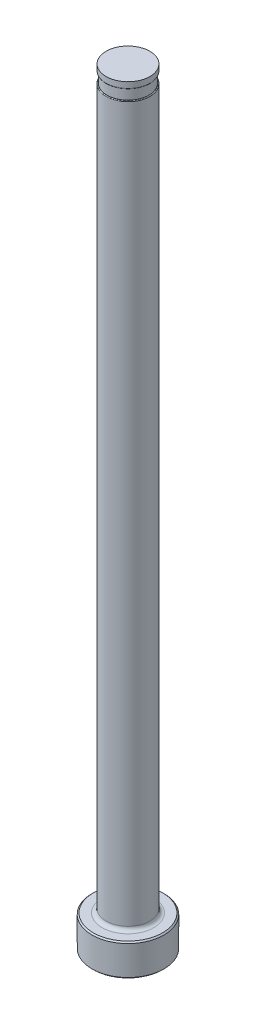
ISO-10303-21;
HEADER;
FILE_DESCRIPTION(('STEP AP214'),'2;1');
FILE_NAME('part.step','',(''),(''),'','','');
FILE_SCHEMA(('AUTOMOTIVE_DESIGN { 1 0 10303 214 1 1 1 1 }'));
ENDSEC;
DATA;
#1=APPLICATION_CONTEXT('core data for automotive mechanical design processes');
#2=APPLICATION_PROTOCOL_DEFINITION('international standard','automotive_design',2000,#1);
#3=PRODUCT_CONTEXT('',#1,'mechanical');
#4=PRODUCT('Part','Part','',(#3));
#5=PRODUCT_RELATED_PRODUCT_CATEGORY('part','',(#4));
#6=PRODUCT_DEFINITION_FORMATION('','',#4);
#7=PRODUCT_DEFINITION_CONTEXT('part definition',#1,'design');
#8=PRODUCT_DEFINITION('design','',#6,#7);
#9=PRODUCT_DEFINITION_SHAPE('','',#8);
#10=(LENGTH_UNIT() NAMED_UNIT(*) SI_UNIT(.MILLI.,.METRE.));
#11=(NAMED_UNIT(*) PLANE_ANGLE_UNIT() SI_UNIT($,.RADIAN.));
#12=(NAMED_UNIT(*) SI_UNIT($,.STERADIAN.) SOLID_ANGLE_UNIT());
#13=UNCERTAINTY_MEASURE_WITH_UNIT(LENGTH_MEASURE(1.E-05),#10,'distance_accuracy_value','');
#14=(GEOMETRIC_REPRESENTATION_CONTEXT(3) GLOBAL_UNCERTAINTY_ASSIGNED_CONTEXT((#13)) GLOBAL_UNIT_ASSIGNED_CONTEXT((#10,
#11,#12)) REPRESENTATION_CONTEXT('',''));
#15=CARTESIAN_POINT('',(0.,0.,0.));
#16=DIRECTION('',(0.,0.,1.));
#17=DIRECTION('',(1.,0.,0.));
#18=AXIS2_PLACEMENT_3D('',#15,#16,#17);
#19=CARTESIAN_POINT('',(-4.36498999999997,151.13,0.));
#20=DIRECTION('',(0.,1.,0.));
#21=DIRECTION('',(0.,0.,1.));
#22=AXIS2_PLACEMENT_3D('',#19,#20,#21);
#23=PLANE('',#22);
#24=CARTESIAN_POINT('',(0.,151.13,0.));
#25=DIRECTION('',(0.,1.,0.));
#26=DIRECTION('',(0.,0.,1.));
#27=AXIS2_PLACEMENT_3D('',#24,#25,#26);
#28=CIRCLE('',#27,4.22528999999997);
#29=CARTESIAN_POINT('',(0.,151.13,4.22528999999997));
#30=VERTEX_POINT('',#29);
#31=EDGE_CURVE('E11',#30,#30,#28,.F.);
#32=ORIENTED_EDGE('',*,*,#31,.T.);
#33=EDGE_LOOP('',(#32));
#34=FACE_BOUND('',#33,.T.);
#35=CARTESIAN_POINT('',(0.,151.13,0.));
#36=DIRECTION('',(0.,1.,0.));
#37=DIRECTION('',(0.,0.,1.));
#38=AXIS2_PLACEMENT_3D('',#35,#36,#37);
#39=CIRCLE('',#38,4.16178999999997);
#40=CARTESIAN_POINT('',(0.,151.13,4.16178999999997));
#41=VERTEX_POINT('',#40);
#42=EDGE_CURVE('E78',#41,#41,#39,.T.);
#43=ORIENTED_EDGE('',*,*,#42,.T.);
#44=EDGE_LOOP('',(#43));
#45=FACE_BOUND('',#44,.T.);
#46=ADVANCED_FACE('F36',(#34,#45),#23,.F.);
#47=CARTESIAN_POINT('',(0.,259.958771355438,0.));
#48=DIRECTION('',(0.,1.,0.));
#49=DIRECTION('',(0.,0.,1.));
#50=AXIS2_PLACEMENT_3D('',#47,#48,#49);
#51=CYLINDRICAL_SURFACE('',#50,4.36498999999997);
#52=DIRECTION('',(0.,1.,0.));
#53=VECTOR('',#52,1.);
#54=CARTESIAN_POINT('',(-4.16178999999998,259.958771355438,-1.31629848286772));
#55=LINE('',#54,#53);
#56=CARTESIAN_POINT('',(-4.16178999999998,148.971,-1.31629848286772));
#57=VERTEX_POINT('',#56);
#58=CARTESIAN_POINT('',(-4.16178999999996,86.614,-1.31629848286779));
#59=VERTEX_POINT('',#58);
#60=EDGE_CURVE('E73',#57,#59,#55,.F.);
#61=ORIENTED_EDGE('',*,*,#60,.F.);
#62=CARTESIAN_POINT('',(0.,148.971,0.));
#63=DIRECTION('',(0.,-1.,0.));
#64=DIRECTION('',(0.,0.,-1.));
#65=AXIS2_PLACEMENT_3D('',#62,#63,#64);
#66=CIRCLE('',#65,4.36498999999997);
#67=CARTESIAN_POINT('',(-4.16178999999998,148.971,1.31629848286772));
#68=VERTEX_POINT('',#67);
#69=EDGE_CURVE('E51',#57,#68,#66,.T.);
#70=ORIENTED_EDGE('',*,*,#69,.T.);
#71=DIRECTION('',(0.,1.,0.));
#72=VECTOR('',#71,1.);
#73=CARTESIAN_POINT('',(-4.16178999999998,259.958771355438,1.31629848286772));
#74=LINE('',#73,#72);
#75=CARTESIAN_POINT('',(-4.16178999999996,86.614,1.31629848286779));
#76=VERTEX_POINT('',#75);
#77=EDGE_CURVE('E84',#76,#68,#74,.T.);
#78=ORIENTED_EDGE('',*,*,#77,.F.);
#79=CARTESIAN_POINT('',(-4.16178999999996,86.614,-1.31629848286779));
#80=CARTESIAN_POINT('',(-4.16178749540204,86.5847945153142,-1.31629969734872));
#81=CARTESIAN_POINT('',(-4.1621934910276,86.5556054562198,-1.31502339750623));
#82=CARTESIAN_POINT('',(-4.16379602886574,86.4974799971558,-1.30994313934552));
#83=CARTESIAN_POINT('',(-4.16499229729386,86.4685435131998,-1.30614005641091));
#84=CARTESIAN_POINT('',(-4.16970978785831,86.3827304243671,-1.29103636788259));
#85=CARTESIAN_POINT('',(-4.1743602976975,86.3265217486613,-1.27604058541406));
#86=CARTESIAN_POINT('',(-4.18613251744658,86.2177895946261,-1.23686822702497));
#87=CARTESIAN_POINT('',(-4.19325232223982,86.1652633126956,-1.2126987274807));
#88=CARTESIAN_POINT('',(-4.2091888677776,86.0650804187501,-1.1561686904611));
#89=CARTESIAN_POINT('',(-4.21800681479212,86.0174273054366,-1.12380232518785));
#90=CARTESIAN_POINT('',(-4.23656898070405,85.9274175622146,-1.05167440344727));
#91=CARTESIAN_POINT('',(-4.24632261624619,85.8851275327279,-1.01183271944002));
#92=CARTESIAN_POINT('',(-4.26580066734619,85.8069847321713,-0.926286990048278));
#93=CARTESIAN_POINT('',(-4.27552507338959,85.7711338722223,-0.88058121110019));
#94=CARTESIAN_POINT('',(-4.29543366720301,85.701720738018,-0.778110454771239));
#95=CARTESIAN_POINT('',(-4.3055056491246,85.669104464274,-0.720683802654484));
#96=CARTESIAN_POINT('',(-4.32376922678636,85.6123921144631,-0.601498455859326));
#97=CARTESIAN_POINT('',(-4.33195978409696,85.5883007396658,-0.539737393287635));
#98=CARTESIAN_POINT('',(-4.34685789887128,85.5455798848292,-0.404062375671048));
#99=CARTESIAN_POINT('',(-4.35317398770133,85.5282625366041,-0.329691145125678));
#100=CARTESIAN_POINT('',(-4.36197215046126,85.5043864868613,-0.179011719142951));
#101=CARTESIAN_POINT('',(-4.3644520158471,85.4978339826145,-0.102702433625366));
#102=CARTESIAN_POINT('',(-4.36541803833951,85.4952580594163,0.058182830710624));
#103=CARTESIAN_POINT('',(-4.36345629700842,85.5004156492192,0.142783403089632));
#104=CARTESIAN_POINT('',(-4.35477620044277,85.5238747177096,0.309955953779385));
#105=CARTESIAN_POINT('',(-4.34805523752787,85.5421834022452,0.392526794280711));
#106=CARTESIAN_POINT('',(-4.33049146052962,85.5924757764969,0.55371755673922));
#107=CARTESIAN_POINT('',(-4.31961605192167,85.6245678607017,0.632300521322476));
#108=CARTESIAN_POINT('',(-4.29509465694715,85.7027472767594,0.78166915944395));
#109=CARTESIAN_POINT('',(-4.28145345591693,85.7488105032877,0.852467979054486));
#110=CARTESIAN_POINT('',(-4.25707286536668,85.8409515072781,0.96588299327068));
#111=CARTESIAN_POINT('',(-4.24649547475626,85.8839441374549,1.01105227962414));
#112=CARTESIAN_POINT('',(-4.22598230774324,85.9770038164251,1.09362608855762));
#113=CARTESIAN_POINT('',(-4.21604624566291,86.0270676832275,1.13103408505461));
#114=CARTESIAN_POINT('',(-4.19787550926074,86.1336091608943,1.19672699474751));
#115=CARTESIAN_POINT('',(-4.18965172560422,86.1901244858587,1.22495411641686));
#116=CARTESIAN_POINT('',(-4.17605152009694,86.3076762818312,1.27055384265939));
#117=CARTESIAN_POINT('',(-4.17067066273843,86.3687055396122,1.28794336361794));
#118=CARTESIAN_POINT('',(-4.1653318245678,86.4610266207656,1.30505888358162));
#119=CARTESIAN_POINT('',(-4.16400812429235,86.4914684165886,1.30926961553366));
#120=CARTESIAN_POINT('',(-4.16223627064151,86.5526003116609,1.31488836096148));
#121=CARTESIAN_POINT('',(-4.16178714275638,86.5832900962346,1.31629949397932));
#122=CARTESIAN_POINT('',(-4.16178999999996,86.614,1.31629848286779));
#123=B_SPLINE_CURVE_WITH_KNOTS('',3,(#79,#80,#81,#82,#83,#84,#85,#86,#87,#88,#89,#90,#91,#92,
#93,#94,#95,#96,#97,#98,#99,#100,#101,#102,#103,#104,#105,#106,#107,#108,#109,#110,#111,#112,
#113,#114,#115,#116,#117,#118,#119,#120,#121,#122),.UNSPECIFIED.,.F.,.F.,(4,2,2,2,2,2,2,2,2,2,2,
2,2,2,2,2,2,2,2,2,2,4),(0.,0.0875537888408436,0.175077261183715,0.349153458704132,
0.523095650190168,0.697161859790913,0.873213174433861,1.04931665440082,1.24895267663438,
1.44869862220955,1.6776260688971,1.90668526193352,2.15985748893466,2.41316854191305,
2.66850922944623,2.92341184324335,3.11238644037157,3.30127627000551,3.49133308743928,
3.68109249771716,3.77325015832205,3.86530507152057),.UNSPECIFIED.);
#124=EDGE_CURVE('E81',#59,#76,#123,.T.);
#125=ORIENTED_EDGE('',*,*,#124,.F.);
#126=EDGE_LOOP('',(#61,#70,#78,#125));
#127=FACE_BOUND('',#126,.T.);
#128=CARTESIAN_POINT('',(0.,7.11200000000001,0.));
#129=DIRECTION('',(0.,1.,0.));
#130=DIRECTION('',(0.,0.,1.));
#131=AXIS2_PLACEMENT_3D('',#128,#129,#130);
#132=CIRCLE('',#131,4.36498999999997);
#133=CARTESIAN_POINT('',(0.,7.11200000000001,4.36498999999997));
#134=VERTEX_POINT('',#133);
#135=EDGE_CURVE('E116',#134,#134,#132,.T.);
#136=ORIENTED_EDGE('',*,*,#135,.T.);
#137=EDGE_LOOP('',(#136));
#138=FACE_BOUND('',#137,.T.);
#139=ADVANCED_FACE('F82',(#127,#138),#51,.T.);
#140=CARTESIAN_POINT('',(0.,0.,0.));
#141=DIRECTION('',(0.,-1.,0.));
#142=DIRECTION('',(0.,0.,-1.));
#143=AXIS2_PLACEMENT_3D('',#140,#141,#142);
#144=PLANE('',#143);
#145=CARTESIAN_POINT('',(0.,0.,0.));
#146=DIRECTION('',(0.,-1.,0.));
#147=DIRECTION('',(0.,0.,-1.));
#148=AXIS2_PLACEMENT_3D('',#145,#146,#147);
#149=CIRCLE('',#148,6.88339999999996);
#150=CARTESIAN_POINT('',(0.,0.,-6.88339999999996));
#151=VERTEX_POINT('',#150);
#152=EDGE_CURVE('E113',#151,#151,#149,.T.);
#153=ORIENTED_EDGE('',*,*,#152,.T.);
#154=EDGE_LOOP('',(#153));
#155=FACE_BOUND('',#154,.T.);
#156=ADVANCED_FACE('F192',(#155),#144,.T.);
#157=CARTESIAN_POINT('',(0.,259.958771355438,0.));
#158=DIRECTION('',(0.,1.,0.));
#159=DIRECTION('',(0.,0.,1.));
#160=AXIS2_PLACEMENT_3D('',#157,#158,#159);
#161=CYLINDRICAL_SURFACE('',#160,7.13739999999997);
#162=CARTESIAN_POINT('',(0.,6.09599999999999,0.));
#163=DIRECTION('',(0.,1.,0.));
#164=DIRECTION('',(0.,0.,1.));
#165=AXIS2_PLACEMENT_3D('',#162,#163,#164);
#166=CIRCLE('',#165,7.13739999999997);
#167=CARTESIAN_POINT('',(0.,6.09599999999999,7.13739999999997));
#168=VERTEX_POINT('',#167);
#169=EDGE_CURVE('E110',#168,#168,#166,.F.);
#170=ORIENTED_EDGE('',*,*,#169,.T.);
#171=EDGE_LOOP('',(#170));
#172=FACE_BOUND('',#171,.T.);
#173=CARTESIAN_POINT('',(0.,0.254000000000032,0.));
#174=DIRECTION('',(0.,-1.,0.));
#175=DIRECTION('',(0.,0.,-1.));
#176=AXIS2_PLACEMENT_3D('',#173,#174,#175);
#177=CIRCLE('',#176,7.13739999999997);
#178=CARTESIAN_POINT('',(0.,0.254000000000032,-7.13739999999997));
#179=VERTEX_POINT('',#178);
#180=EDGE_CURVE('E107',#179,#179,#177,.F.);
#181=ORIENTED_EDGE('',*,*,#180,.T.);
#182=EDGE_LOOP('',(#181));
#183=FACE_BOUND('',#182,.T.);
#184=ADVANCED_FACE('F195',(#172,#183),#161,.T.);
#185=CARTESIAN_POINT('',(-7.13739999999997,6.35,0.));
#186=DIRECTION('',(0.,1.,0.));
#187=DIRECTION('',(0.,0.,1.));
#188=AXIS2_PLACEMENT_3D('',#185,#186,#187);
#189=PLANE('',#188);
#190=CARTESIAN_POINT('',(0.,6.35,0.));
#191=DIRECTION('',(0.,1.,0.));
#192=DIRECTION('',(0.,0.,1.));
#193=AXIS2_PLACEMENT_3D('',#190,#191,#192);
#194=CIRCLE('',#193,5.12698999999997);
#195=CARTESIAN_POINT('',(0.,6.35,5.12698999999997));
#196=VERTEX_POINT('',#195);
#197=EDGE_CURVE('E87',#196,#196,#194,.F.);
#198=ORIENTED_EDGE('',*,*,#197,.T.);
#199=EDGE_LOOP('',(#198));
#200=FACE_BOUND('',#199,.T.);
#201=CARTESIAN_POINT('',(0.,6.35,0.));
#202=DIRECTION('',(0.,1.,0.));
#203=DIRECTION('',(0.,0.,1.));
#204=AXIS2_PLACEMENT_3D('',#201,#202,#203);
#205=CIRCLE('',#204,6.88340000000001);
#206=CARTESIAN_POINT('',(0.,6.35,6.88340000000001));
#207=VERTEX_POINT('',#206);
#208=EDGE_CURVE('E104',#207,#207,#205,.T.);
#209=ORIENTED_EDGE('',*,*,#208,.T.);
#210=EDGE_LOOP('',(#209));
#211=FACE_BOUND('',#210,.T.);
#212=ADVANCED_FACE('F190',(#200,#211),#189,.T.);
#213=CARTESIAN_POINT('',(0.,6.35000000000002,0.));
#214=DIRECTION('',(0.,-1.,0.));
#215=DIRECTION('',(0.,0.,-1.));
#216=AXIS2_PLACEMENT_3D('',#213,#214,#215);
#217=CONICAL_SURFACE('',#216,6.88339999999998,0.785398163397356);
#218=ORIENTED_EDGE('',*,*,#169,.F.);
#219=EDGE_LOOP('',(#218));
#220=FACE_BOUND('',#219,.T.);
#221=ORIENTED_EDGE('',*,*,#208,.F.);
#222=EDGE_LOOP('',(#221));
#223=FACE_BOUND('',#222,.T.);
#224=ADVANCED_FACE('F186',(#220,#223),#217,.T.);
#225=CARTESIAN_POINT('',(0.,0.254000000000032,0.));
#226=DIRECTION('',(0.,1.,0.));
#227=DIRECTION('',(0.,0.,1.));
#228=AXIS2_PLACEMENT_3D('',#225,#226,#227);
#229=CONICAL_SURFACE('',#228,7.13739999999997,0.785398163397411);
#230=ORIENTED_EDGE('',*,*,#152,.F.);
#231=EDGE_LOOP('',(#230));
#232=FACE_BOUND('',#231,.T.);
#233=ORIENTED_EDGE('',*,*,#180,.F.);
#234=EDGE_LOOP('',(#233));
#235=FACE_BOUND('',#234,.T.);
#236=ADVANCED_FACE('F182',(#232,#235),#229,.T.);
#237=CARTESIAN_POINT('',(0.,7.11200000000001,0.));
#238=DIRECTION('',(0.,1.,0.));
#239=DIRECTION('',(0.,0.,1.));
#240=AXIS2_PLACEMENT_3D('',#237,#238,#239);
#241=TOROIDAL_SURFACE('',#240,5.12698999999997,0.762);
#242=ORIENTED_EDGE('',*,*,#197,.F.);
#243=EDGE_LOOP('',(#242));
#244=FACE_BOUND('',#243,.T.);
#245=ORIENTED_EDGE('',*,*,#135,.F.);
#246=EDGE_LOOP('',(#245));
#247=FACE_BOUND('',#246,.T.);
#248=ADVANCED_FACE('F147',(#244,#247),#241,.F.);
#249=CARTESIAN_POINT('',(-4.36498999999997,149.098,0.));
#250=DIRECTION('',(0.,-1.,0.));
#251=DIRECTION('',(0.,0.,-1.));
#252=AXIS2_PLACEMENT_3D('',#249,#250,#251);
#253=PLANE('',#252);
#254=DIRECTION('',(0.,0.,1.));
#255=VECTOR('',#254,1.);
#256=CARTESIAN_POINT('',(-4.16178999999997,149.098,0.));
#257=LINE('',#256,#255);
#258=CARTESIAN_POINT('',(-4.16178999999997,149.098,0.));
#259=VERTEX_POINT('',#258);
#260=CARTESIAN_POINT('',(-4.16178999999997,149.098,0.800039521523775));
#261=VERTEX_POINT('',#260);
#262=EDGE_CURVE('E90',#259,#261,#257,.T.);
#263=ORIENTED_EDGE('',*,*,#262,.T.);
#264=CARTESIAN_POINT('',(0.,149.098,0.));
#265=DIRECTION('',(0.,-1.,0.));
#266=DIRECTION('',(0.,0.,-1.));
#267=AXIS2_PLACEMENT_3D('',#264,#265,#266);
#268=CIRCLE('',#267,4.23798999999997);
#269=CARTESIAN_POINT('',(-4.16178999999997,149.098,-0.800039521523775));
#270=VERTEX_POINT('',#269);
#271=EDGE_CURVE('E86',#261,#270,#268,.F.);
#272=ORIENTED_EDGE('',*,*,#271,.T.);
#273=EDGE_CURVE('E79',#270,#259,#257,.T.);
#274=ORIENTED_EDGE('',*,*,#273,.T.);
#275=CARTESIAN_POINT('',(0.,149.098,0.));
#276=DIRECTION('',(0.,1.,0.));
#277=DIRECTION('',(0.,0.,1.));
#278=AXIS2_PLACEMENT_3D('',#275,#276,#277);
#279=CIRCLE('',#278,4.16178999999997);
#280=EDGE_CURVE('E101',#259,#259,#279,.T.);
#281=ORIENTED_EDGE('',*,*,#280,.F.);
#282=EDGE_LOOP('',(#263,#272,#274,#281));
#283=FACE_BOUND('',#282,.T.);
#284=ADVANCED_FACE('F144',(#283),#253,.F.);
#285=CARTESIAN_POINT('',(0.,153.448281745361,0.));
#286=DIRECTION('',(0.,1.,0.));
#287=DIRECTION('',(0.,0.,1.));
#288=AXIS2_PLACEMENT_3D('',#285,#286,#287);
#289=CYLINDRICAL_SURFACE('',#288,4.16178999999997);
#290=ORIENTED_EDGE('',*,*,#42,.F.);
#291=EDGE_LOOP('',(#290));
#292=FACE_BOUND('',#291,.T.);
#293=ORIENTED_EDGE('',*,*,#280,.T.);
#294=EDGE_LOOP('',(#293));
#295=FACE_BOUND('',#294,.T.);
#296=ADVANCED_FACE('F141',(#292,#295),#289,.T.);
#297=CARTESIAN_POINT('',(-4.16178999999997,150.114,-7.13739999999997));
#298=DIRECTION('',(1.,0.,0.));
#299=DIRECTION('',(0.,1.,0.));
#300=AXIS2_PLACEMENT_3D('',#297,#298,#299);
#301=PLANE('',#300);
#302=ORIENTED_EDGE('',*,*,#273,.F.);
#303=CARTESIAN_POINT('',(-4.16178999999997,149.098,-0.800039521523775));
#304=CARTESIAN_POINT('',(-4.16178999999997,149.097995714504,-0.82118028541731));
#305=CARTESIAN_POINT('',(-4.16178999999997,149.097811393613,-0.842323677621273));
#306=CARTESIAN_POINT('',(-4.16178999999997,149.096968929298,-0.884617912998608));
#307=CARTESIAN_POINT('',(-4.16178999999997,149.096310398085,-0.905768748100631));
#308=CARTESIAN_POINT('',(-4.16178999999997,149.09440080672,-0.948147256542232));
#309=CARTESIAN_POINT('',(-4.16178999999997,149.09314690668,-0.969374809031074));
#310=CARTESIAN_POINT('',(-4.16178999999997,149.089884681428,-1.01176701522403));
#311=CARTESIAN_POINT('',(-4.16178999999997,149.08787661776,-1.03293168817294));
#312=CARTESIAN_POINT('',(-4.16178999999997,149.083582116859,-1.0691753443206));
#313=CARTESIAN_POINT('',(-4.16178999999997,149.081535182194,-1.08428194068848));
#314=CARTESIAN_POINT('',(-4.16178999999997,149.07680524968,-1.11437533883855));
#315=CARTESIAN_POINT('',(-4.16178999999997,149.074123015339,-1.12936226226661));
#316=CARTESIAN_POINT('',(-4.16178999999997,149.06671784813,-1.1651316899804));
#317=CARTESIAN_POINT('',(-4.16178999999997,149.061607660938,-1.18584256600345));
#318=CARTESIAN_POINT('',(-4.16178999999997,149.051913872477,-1.21666683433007));
#319=CARTESIAN_POINT('',(-4.16178999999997,149.048267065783,-1.22706935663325));
#320=CARTESIAN_POINT('',(-4.16178999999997,149.040021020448,-1.24746733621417));
#321=CARTESIAN_POINT('',(-4.16178999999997,149.035424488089,-1.25746385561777));
#322=CARTESIAN_POINT('',(-4.16178999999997,149.025697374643,-1.27503085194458));
#323=CARTESIAN_POINT('',(-4.16178999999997,149.020799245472,-1.28272062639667));
#324=CARTESIAN_POINT('',(-4.16178999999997,149.012266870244,-1.29339494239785));
#325=CARTESIAN_POINT('',(-4.16178999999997,149.009203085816,-1.29682769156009));
#326=CARTESIAN_POINT('',(-4.16178999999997,149.002576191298,-1.3031775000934));
#327=CARTESIAN_POINT('',(-4.16178999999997,148.999014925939,-1.30609637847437));
#328=CARTESIAN_POINT('',(-4.16178999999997,148.993046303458,-1.30995281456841));
#329=CARTESIAN_POINT('',(-4.16178999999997,148.990835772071,-1.31119247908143));
#330=CARTESIAN_POINT('',(-4.16178999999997,148.986254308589,-1.31331673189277));
#331=CARTESIAN_POINT('',(-4.16178999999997,148.983883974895,-1.31420256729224));
#332=CARTESIAN_POINT('',(-4.16178999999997,148.979757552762,-1.31533351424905));
#333=CARTESIAN_POINT('',(-4.16178999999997,148.978032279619,-1.31569134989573));
#334=CARTESIAN_POINT('',(-4.16178999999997,148.97453901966,-1.31617571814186));
#335=CARTESIAN_POINT('',(-4.16178999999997,148.972770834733,-1.31630080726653));
#336=CARTESIAN_POINT('',(-4.16178999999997,148.971000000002,-1.31629848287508));
#337=B_SPLINE_CURVE_WITH_KNOTS('',3,(#303,#304,#305,#306,#307,#308,#309,#310,#311,#312,#313,
#314,#315,#316,#317,#318,#319,#320,#321,#322,#323,#324,#325,#326,#327,#328,#329,#330,#331,#332,
#333,#334,#335,#336),.UNSPECIFIED.,.F.,.F.,(4,2,2,2,2,2,2,2,2,2,2,2,2,2,2,2,4),(0.,
0.0634255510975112,0.126903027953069,0.190686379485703,0.25444763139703,0.300168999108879,
0.345835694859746,0.409709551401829,0.44274703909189,0.475691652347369,0.50289830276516,
0.516668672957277,0.530389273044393,0.537969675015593,0.545523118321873,0.550794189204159,
0.556097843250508),.UNSPECIFIED.);
#338=EDGE_CURVE('E59',#270,#57,#337,.T.);
#339=ORIENTED_EDGE('',*,*,#338,.T.);
#340=ORIENTED_EDGE('',*,*,#60,.T.);
#341=DIRECTION('',(0.,0.,1.));
#342=VECTOR('',#341,1.);
#343=CARTESIAN_POINT('',(-4.16178999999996,86.614,-7.13739999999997));
#344=LINE('',#343,#342);
#345=EDGE_CURVE('E77',#59,#76,#344,.T.);
#346=ORIENTED_EDGE('',*,*,#345,.T.);
#347=ORIENTED_EDGE('',*,*,#77,.T.);
#348=CARTESIAN_POINT('',(-4.16178999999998,148.971,1.31629848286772));
#349=CARTESIAN_POINT('',(-4.16178999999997,148.973523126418,1.31630667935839));
#350=CARTESIAN_POINT('',(-4.16178999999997,148.976034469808,1.31604955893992));
#351=CARTESIAN_POINT('',(-4.16178999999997,148.980933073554,1.31508340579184));
#352=CARTESIAN_POINT('',(-4.16178999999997,148.983321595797,1.31438089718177));
#353=CARTESIAN_POINT('',(-4.16178999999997,148.988507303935,1.31238416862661));
#354=CARTESIAN_POINT('',(-4.16178999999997,148.991264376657,1.31098819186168));
#355=CARTESIAN_POINT('',(-4.16178999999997,148.996531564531,1.30777210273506));
#356=CARTESIAN_POINT('',(-4.16178999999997,148.999040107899,1.30594950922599));
#357=CARTESIAN_POINT('',(-4.16178999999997,149.00552418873,1.30060082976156));
#358=CARTESIAN_POINT('',(-4.16178999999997,149.009261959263,1.2967903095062));
#359=CARTESIAN_POINT('',(-4.16178999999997,149.016164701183,1.28869316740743));
#360=CARTESIAN_POINT('',(-4.16178999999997,149.019328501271,1.28440560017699));
#361=CARTESIAN_POINT('',(-4.16178999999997,149.030792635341,1.26723154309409));
#362=CARTESIAN_POINT('',(-4.16178999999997,149.037556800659,1.25334498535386));
#363=CARTESIAN_POINT('',(-4.16178999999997,149.049249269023,1.22482528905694));
#364=CARTESIAN_POINT('',(-4.16178999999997,149.054164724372,1.21018770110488));
#365=CARTESIAN_POINT('',(-4.16178999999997,149.066246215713,1.16868418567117));
#366=CARTESIAN_POINT('',(-4.16178999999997,149.072057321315,1.14142260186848));
#367=CARTESIAN_POINT('',(-4.16178999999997,149.081470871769,1.08650877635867));
#368=CARTESIAN_POINT('',(-4.16178999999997,149.085067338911,1.05885568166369));
#369=CARTESIAN_POINT('',(-4.16178999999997,149.090732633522,1.00338718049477));
#370=CARTESIAN_POINT('',(-4.16178999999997,149.092801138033,0.975571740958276));
#371=CARTESIAN_POINT('',(-4.16178999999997,149.095839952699,0.91991680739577));
#372=CARTESIAN_POINT('',(-4.16178999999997,149.096811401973,0.892077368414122));
#373=CARTESIAN_POINT('',(-4.16178999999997,149.097591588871,0.853520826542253));
#374=CARTESIAN_POINT('',(-4.16178999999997,149.097747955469,0.842809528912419));
#375=CARTESIAN_POINT('',(-4.16178999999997,149.097951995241,0.821412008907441));
#376=CARTESIAN_POINT('',(-4.16178999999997,149.097999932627,0.810725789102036));
#377=CARTESIAN_POINT('',(-4.16178999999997,149.098,0.800039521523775));
#378=B_SPLINE_CURVE_WITH_KNOTS('',3,(#348,#349,#350,#351,#352,#353,#354,#355,#356,#357,#358,
#359,#360,#361,#362,#363,#364,#365,#366,#367,#368,#369,#370,#371,#372,#373,#374,#375,#376,#377),
.UNSPECIFIED.,.F.,.F.,(4,2,2,2,2,2,2,2,2,2,2,2,2,2,4),(0.,0.00753740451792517,
0.0149668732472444,0.0241855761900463,0.0334592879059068,0.0493821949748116,0.0653372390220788,
0.111313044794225,0.157602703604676,0.24100233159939,0.324626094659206,0.408267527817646,
0.491822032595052,0.523958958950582,0.556017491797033),.UNSPECIFIED.);
#379=EDGE_CURVE('E172',#68,#261,#378,.T.);
#380=ORIENTED_EDGE('',*,*,#379,.T.);
#381=ORIENTED_EDGE('',*,*,#262,.F.);
#382=EDGE_LOOP('',(#302,#339,#340,#346,#347,#380,#381));
#383=FACE_BOUND('',#382,.T.);
#384=ADVANCED_FACE('F75',(#383),#301,.F.);
#385=CARTESIAN_POINT('',(-7.33678999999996,86.614,-7.13739999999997));
#386=DIRECTION('',(0.,0.,1.));
#387=DIRECTION('',(1.,0.,0.));
#388=AXIS2_PLACEMENT_3D('',#385,#386,#387);
#389=CYLINDRICAL_SURFACE('',#388,3.175);
#390=ORIENTED_EDGE('',*,*,#345,.F.);
#391=ORIENTED_EDGE('',*,*,#124,.T.);
#392=EDGE_LOOP('',(#390,#391));
#393=FACE_BOUND('',#392,.T.);
#394=ADVANCED_FACE('F89',(#393),#389,.F.);
#395=CARTESIAN_POINT('',(0.,152.687735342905,0.));
#396=DIRECTION('',(0.,1.,0.));
#397=DIRECTION('',(0.,0.,1.));
#398=AXIS2_PLACEMENT_3D('',#395,#396,#397);
#399=CYLINDRICAL_SURFACE('',#398,4.35228999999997);
#400=CARTESIAN_POINT('',(0.,151.257,0.));
#401=DIRECTION('',(0.,1.,0.));
#402=DIRECTION('',(0.,0.,1.));
#403=AXIS2_PLACEMENT_3D('',#400,#401,#402);
#404=CIRCLE('',#403,4.35228999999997);
#405=CARTESIAN_POINT('',(0.,151.257,4.35228999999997));
#406=VERTEX_POINT('',#405);
#407=EDGE_CURVE('E44',#406,#406,#404,.T.);
#408=ORIENTED_EDGE('',*,*,#407,.T.);
#409=EDGE_LOOP('',(#408));
#410=FACE_BOUND('',#409,.T.);
#411=CARTESIAN_POINT('',(0.,152.4,0.));
#412=DIRECTION('',(0.,1.,0.));
#413=DIRECTION('',(0.,0.,1.));
#414=AXIS2_PLACEMENT_3D('',#411,#412,#413);
#415=CIRCLE('',#414,4.35228999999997);
#416=CARTESIAN_POINT('',(0.,152.4,4.35228999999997));
#417=VERTEX_POINT('',#416);
#418=EDGE_CURVE('E91',#417,#417,#415,.T.);
#419=ORIENTED_EDGE('',*,*,#418,.F.);
#420=EDGE_LOOP('',(#419));
#421=FACE_BOUND('',#420,.T.);
#422=ADVANCED_FACE('F135',(#410,#421),#399,.T.);
#423=CARTESIAN_POINT('',(-4.36498999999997,152.4,0.));
#424=DIRECTION('',(0.,1.,0.));
#425=DIRECTION('',(0.,0.,1.));
#426=AXIS2_PLACEMENT_3D('',#423,#424,#425);
#427=PLANE('',#426);
#428=ORIENTED_EDGE('',*,*,#418,.T.);
#429=EDGE_LOOP('',(#428));
#430=FACE_BOUND('',#429,.T.);
#431=ADVANCED_FACE('F149',(#430),#427,.T.);
#432=CARTESIAN_POINT('',(0.,148.971,0.));
#433=DIRECTION('',(0.,-1.,0.));
#434=DIRECTION('',(0.,0.,-1.));
#435=AXIS2_PLACEMENT_3D('',#432,#433,#434);
#436=TOROIDAL_SURFACE('',#435,4.23798999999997,0.127);
#437=ORIENTED_EDGE('',*,*,#379,.F.);
#438=ORIENTED_EDGE('',*,*,#69,.F.);
#439=ORIENTED_EDGE('',*,*,#338,.F.);
#440=ORIENTED_EDGE('',*,*,#271,.F.);
#441=EDGE_LOOP('',(#437,#438,#439,#440));
#442=FACE_BOUND('',#441,.T.);
#443=ADVANCED_FACE('F151',(#442),#436,.T.);
#444=CARTESIAN_POINT('',(0.,151.257,0.));
#445=DIRECTION('',(0.,1.,0.));
#446=DIRECTION('',(0.,0.,1.));
#447=AXIS2_PLACEMENT_3D('',#444,#445,#446);
#448=TOROIDAL_SURFACE('',#447,4.22528999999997,0.127);
#449=ORIENTED_EDGE('',*,*,#31,.F.);
#450=EDGE_LOOP('',(#449));
#451=FACE_BOUND('',#450,.T.);
#452=ORIENTED_EDGE('',*,*,#407,.F.);
#453=EDGE_LOOP('',(#452));
#454=FACE_BOUND('',#453,.T.);
#455=ADVANCED_FACE('F38',(#451,#454),#448,.T.);
#456=CLOSED_SHELL('',(#46,#139,#156,#184,#212,#224,#236,#248,#284,#296,#384,#394,#422,#431,#443,#455));
#457=MANIFOLD_SOLID_BREP('B2',#456);
#458=ADVANCED_BREP_SHAPE_REPRESENTATION('',(#18,#457),#14);
#459=SHAPE_DEFINITION_REPRESENTATION(#9,#458);
ENDSEC;
END-ISO-10303-21;
